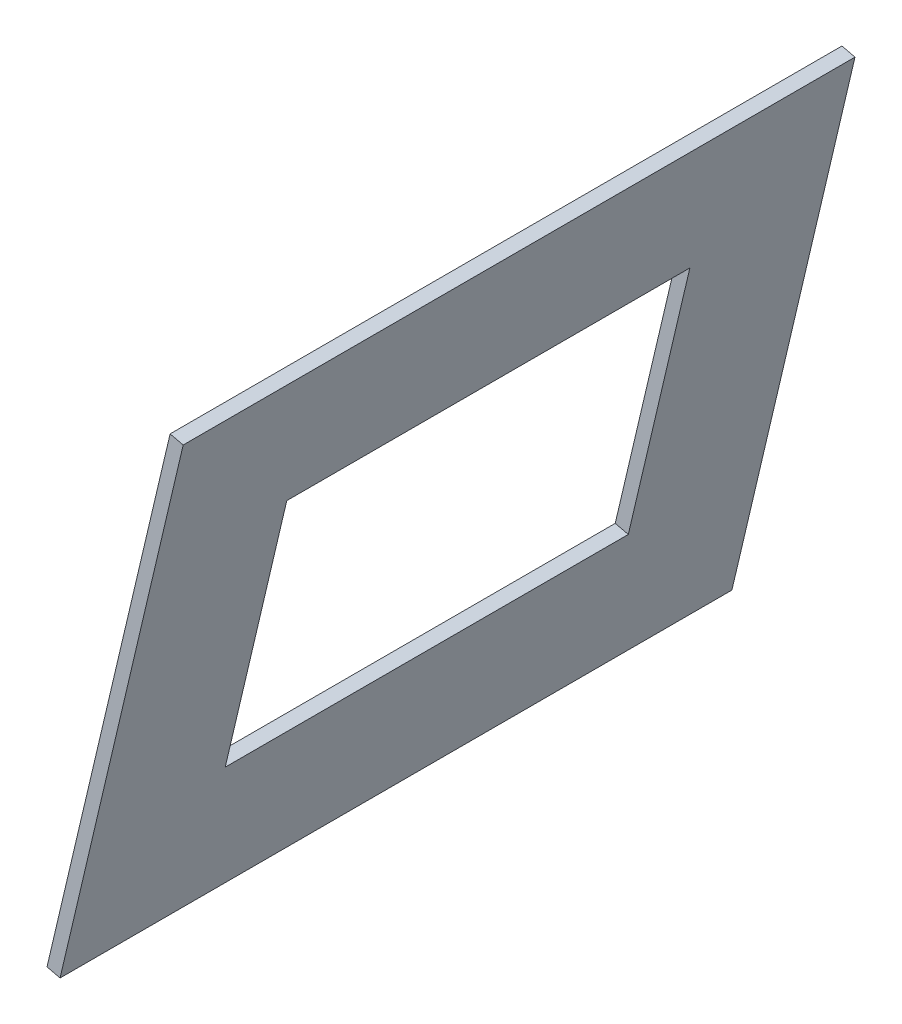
ISO-10303-21;
HEADER;
FILE_DESCRIPTION(('STEP AP214'),'2;1');
FILE_NAME('part.step','',(''),(''),'','','');
FILE_SCHEMA(('AUTOMOTIVE_DESIGN { 1 0 10303 214 1 1 1 1 }'));
ENDSEC;
DATA;
#1=APPLICATION_CONTEXT('core data for automotive mechanical design processes');
#2=APPLICATION_PROTOCOL_DEFINITION('international standard','automotive_design',2000,#1);
#3=PRODUCT_CONTEXT('',#1,'mechanical');
#4=PRODUCT('Part','Part','',(#3));
#5=PRODUCT_RELATED_PRODUCT_CATEGORY('part','',(#4));
#6=PRODUCT_DEFINITION_FORMATION('','',#4);
#7=PRODUCT_DEFINITION_CONTEXT('part definition',#1,'design');
#8=PRODUCT_DEFINITION('design','',#6,#7);
#9=PRODUCT_DEFINITION_SHAPE('','',#8);
#10=(LENGTH_UNIT() NAMED_UNIT(*) SI_UNIT(.MILLI.,.METRE.));
#11=(NAMED_UNIT(*) PLANE_ANGLE_UNIT() SI_UNIT($,.RADIAN.));
#12=(NAMED_UNIT(*) SI_UNIT($,.STERADIAN.) SOLID_ANGLE_UNIT());
#13=UNCERTAINTY_MEASURE_WITH_UNIT(LENGTH_MEASURE(1.E-05),#10,'distance_accuracy_value','');
#14=(GEOMETRIC_REPRESENTATION_CONTEXT(3) GLOBAL_UNCERTAINTY_ASSIGNED_CONTEXT((#13)) GLOBAL_UNIT_ASSIGNED_CONTEXT((#10,
#11,#12)) REPRESENTATION_CONTEXT('',''));
#15=CARTESIAN_POINT('',(0.,0.,0.));
#16=DIRECTION('',(0.,0.,1.));
#17=DIRECTION('',(1.,0.,0.));
#18=AXIS2_PLACEMENT_3D('',#15,#16,#17);
#19=CARTESIAN_POINT('',(-238.219832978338,152.785786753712,904.558696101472));
#20=DIRECTION('',(0.973408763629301,-0.2290750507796,0.));
#21=DIRECTION('',(0.2290750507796,0.973408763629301,0.));
#22=AXIS2_PLACEMENT_3D('',#19,#20,#21);
#23=PLANE('',#22);
#24=DIRECTION('',(0.,0.,-1.));
#25=VECTOR('',#24,1.);
#26=CARTESIAN_POINT('',(-215.312327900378,250.126663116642,904.558696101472));
#27=LINE('',#26,#25);
#28=CARTESIAN_POINT('',(-215.312327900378,250.126663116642,400.));
#29=VERTEX_POINT('',#28);
#30=CARTESIAN_POINT('',(-215.312327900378,250.126663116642,100.));
#31=VERTEX_POINT('',#30);
#32=EDGE_CURVE('E98',#29,#31,#27,.T.);
#33=ORIENTED_EDGE('',*,*,#32,.T.);
#34=DIRECTION('',(0.2290750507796,0.973408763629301,0.));
#35=VECTOR('',#34,1.);
#36=CARTESIAN_POINT('',(-238.219832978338,152.785786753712,100.));
#37=LINE('',#36,#35);
#38=CARTESIAN_POINT('',(-169.497317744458,444.808415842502,100.));
#39=VERTEX_POINT('',#38);
#40=EDGE_CURVE('E119',#31,#39,#37,.T.);
#41=ORIENTED_EDGE('',*,*,#40,.T.);
#42=DIRECTION('',(0.,0.,1.));
#43=VECTOR('',#42,1.);
#44=CARTESIAN_POINT('',(-169.497317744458,444.808415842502,904.558696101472));
#45=LINE('',#44,#43);
#46=CARTESIAN_POINT('',(-169.497317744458,444.808415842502,400.));
#47=VERTEX_POINT('',#46);
#48=EDGE_CURVE('E117',#39,#47,#45,.T.);
#49=ORIENTED_EDGE('',*,*,#48,.T.);
#50=DIRECTION('',(-0.2290750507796,-0.973408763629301,0.));
#51=VECTOR('',#50,1.);
#52=CARTESIAN_POINT('',(-238.219832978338,152.785786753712,400.));
#53=LINE('',#52,#51);
#54=EDGE_CURVE('E103',#47,#29,#53,.T.);
#55=ORIENTED_EDGE('',*,*,#54,.T.);
#56=EDGE_LOOP('',(#33,#41,#49,#55));
#57=FACE_BOUND('',#56,.T.);
#58=DIRECTION('',(-0.2290750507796,-0.973408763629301,0.));
#59=VECTOR('',#58,1.);
#60=CARTESIAN_POINT('',(-238.219832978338,152.785786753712,500.));
#61=LINE('',#60,#59);
#62=CARTESIAN_POINT('',(-146.589812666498,542.149292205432,500.));
#63=VERTEX_POINT('',#62);
#64=CARTESIAN_POINT('',(-238.219832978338,152.785786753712,500.));
#65=VERTEX_POINT('',#64);
#66=EDGE_CURVE('E130',#63,#65,#61,.T.);
#67=ORIENTED_EDGE('',*,*,#66,.F.);
#68=DIRECTION('',(0.,0.,-1.));
#69=VECTOR('',#68,1.);
#70=CARTESIAN_POINT('',(-146.589812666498,542.149292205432,904.558696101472));
#71=LINE('',#70,#69);
#72=CARTESIAN_POINT('',(-146.589812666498,542.149292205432,0.));
#73=VERTEX_POINT('',#72);
#74=EDGE_CURVE('E144',#63,#73,#71,.T.);
#75=ORIENTED_EDGE('',*,*,#74,.T.);
#76=DIRECTION('',(-0.2290750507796,-0.973408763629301,0.));
#77=VECTOR('',#76,1.);
#78=CARTESIAN_POINT('',(-238.219832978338,152.785786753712,0.));
#79=LINE('',#78,#77);
#80=CARTESIAN_POINT('',(-238.219832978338,152.785786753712,0.));
#81=VERTEX_POINT('',#80);
#82=EDGE_CURVE('E124',#73,#81,#79,.T.);
#83=ORIENTED_EDGE('',*,*,#82,.T.);
#84=DIRECTION('',(0.,0.,-1.));
#85=VECTOR('',#84,1.);
#86=CARTESIAN_POINT('',(-238.219832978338,152.785786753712,904.558696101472));
#87=LINE('',#86,#85);
#88=EDGE_CURVE('E128',#65,#81,#87,.T.);
#89=ORIENTED_EDGE('',*,*,#88,.F.);
#90=EDGE_LOOP('',(#67,#75,#83,#89));
#91=FACE_BOUND('',#90,.T.);
#92=ADVANCED_FACE('F37',(#57,#91),#23,.F.);
#93=CARTESIAN_POINT('',(-238.219832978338,152.785786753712,904.558696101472));
#94=DIRECTION('',(0.229075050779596,0.973408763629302,0.));
#95=DIRECTION('',(-0.973408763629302,0.229075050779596,0.));
#96=AXIS2_PLACEMENT_3D('',#93,#94,#95);
#97=PLANE('',#96);
#98=DIRECTION('',(0.973408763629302,-0.229075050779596,0.));
#99=VECTOR('',#98,1.);
#100=CARTESIAN_POINT('',(-238.219832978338,152.785786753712,500.));
#101=LINE('',#100,#99);
#102=CARTESIAN_POINT('',(-228.485745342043,150.495036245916,500.));
#103=VERTEX_POINT('',#102);
#104=EDGE_CURVE('E127',#65,#103,#101,.T.);
#105=ORIENTED_EDGE('',*,*,#104,.F.);
#106=ORIENTED_EDGE('',*,*,#88,.T.);
#107=DIRECTION('',(0.973408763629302,-0.229075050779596,0.));
#108=VECTOR('',#107,1.);
#109=CARTESIAN_POINT('',(-238.219832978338,152.785786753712,0.));
#110=LINE('',#109,#108);
#111=CARTESIAN_POINT('',(-228.485745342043,150.495036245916,0.));
#112=VERTEX_POINT('',#111);
#113=EDGE_CURVE('E135',#81,#112,#110,.T.);
#114=ORIENTED_EDGE('',*,*,#113,.T.);
#115=DIRECTION('',(0.,0.,-1.));
#116=VECTOR('',#115,1.);
#117=CARTESIAN_POINT('',(-228.485745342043,150.495036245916,904.558696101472));
#118=LINE('',#117,#116);
#119=EDGE_CURVE('E148',#103,#112,#118,.T.);
#120=ORIENTED_EDGE('',*,*,#119,.F.);
#121=EDGE_LOOP('',(#105,#106,#114,#120));
#122=FACE_BOUND('',#121,.T.);
#123=ADVANCED_FACE('F180',(#122),#97,.F.);
#124=CARTESIAN_POINT('',(-228.485745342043,150.495036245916,904.558696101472));
#125=DIRECTION('',(-0.973408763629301,0.229075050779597,0.));
#126=DIRECTION('',(-0.229075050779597,-0.973408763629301,0.));
#127=AXIS2_PLACEMENT_3D('',#124,#125,#126);
#128=PLANE('',#127);
#129=DIRECTION('',(0.,0.,-1.));
#130=VECTOR('',#129,1.);
#131=CARTESIAN_POINT('',(-159.763230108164,442.517665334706,904.558696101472));
#132=LINE('',#131,#130);
#133=CARTESIAN_POINT('',(-159.763230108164,442.517665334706,400.));
#134=VERTEX_POINT('',#133);
#135=CARTESIAN_POINT('',(-159.763230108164,442.517665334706,100.));
#136=VERTEX_POINT('',#135);
#137=EDGE_CURVE('E44',#134,#136,#132,.T.);
#138=ORIENTED_EDGE('',*,*,#137,.T.);
#139=DIRECTION('',(-0.229075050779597,-0.973408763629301,0.));
#140=VECTOR('',#139,1.);
#141=CARTESIAN_POINT('',(-228.485745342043,150.495036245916,100.));
#142=LINE('',#141,#140);
#143=CARTESIAN_POINT('',(-205.578240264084,247.835912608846,100.));
#144=VERTEX_POINT('',#143);
#145=EDGE_CURVE('E11',#136,#144,#142,.T.);
#146=ORIENTED_EDGE('',*,*,#145,.T.);
#147=DIRECTION('',(0.,0.,1.));
#148=VECTOR('',#147,1.);
#149=CARTESIAN_POINT('',(-205.578240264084,247.835912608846,904.558696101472));
#150=LINE('',#149,#148);
#151=CARTESIAN_POINT('',(-205.578240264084,247.835912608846,400.));
#152=VERTEX_POINT('',#151);
#153=EDGE_CURVE('E153',#144,#152,#150,.T.);
#154=ORIENTED_EDGE('',*,*,#153,.T.);
#155=DIRECTION('',(0.229075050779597,0.973408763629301,0.));
#156=VECTOR('',#155,1.);
#157=CARTESIAN_POINT('',(-228.485745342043,150.495036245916,400.));
#158=LINE('',#157,#156);
#159=EDGE_CURVE('E111',#152,#134,#158,.T.);
#160=ORIENTED_EDGE('',*,*,#159,.T.);
#161=EDGE_LOOP('',(#138,#146,#154,#160));
#162=FACE_BOUND('',#161,.T.);
#163=DIRECTION('',(0.229075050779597,0.973408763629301,0.));
#164=VECTOR('',#163,1.);
#165=CARTESIAN_POINT('',(-228.485745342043,150.495036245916,500.));
#166=LINE('',#165,#164);
#167=CARTESIAN_POINT('',(-136.855725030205,539.858541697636,500.));
#168=VERTEX_POINT('',#167);
#169=EDGE_CURVE('E125',#103,#168,#166,.T.);
#170=ORIENTED_EDGE('',*,*,#169,.F.);
#171=ORIENTED_EDGE('',*,*,#119,.T.);
#172=DIRECTION('',(0.229075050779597,0.973408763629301,0.));
#173=VECTOR('',#172,1.);
#174=CARTESIAN_POINT('',(-228.485745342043,150.495036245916,0.));
#175=LINE('',#174,#173);
#176=CARTESIAN_POINT('',(-136.855725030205,539.858541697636,0.));
#177=VERTEX_POINT('',#176);
#178=EDGE_CURVE('E138',#112,#177,#175,.T.);
#179=ORIENTED_EDGE('',*,*,#178,.T.);
#180=DIRECTION('',(0.,0.,-1.));
#181=VECTOR('',#180,1.);
#182=CARTESIAN_POINT('',(-136.855725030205,539.858541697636,904.558696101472));
#183=LINE('',#182,#181);
#184=EDGE_CURVE('E146',#168,#177,#183,.T.);
#185=ORIENTED_EDGE('',*,*,#184,.F.);
#186=EDGE_LOOP('',(#170,#171,#179,#185));
#187=FACE_BOUND('',#186,.T.);
#188=ADVANCED_FACE('F157',(#162,#187),#128,.F.);
#189=CARTESIAN_POINT('',(-146.589812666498,542.149292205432,904.558696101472));
#190=DIRECTION('',(-0.229075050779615,-0.973408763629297,0.));
#191=DIRECTION('',(0.973408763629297,-0.229075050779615,0.));
#192=AXIS2_PLACEMENT_3D('',#189,#190,#191);
#193=PLANE('',#192);
#194=DIRECTION('',(-0.973408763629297,0.229075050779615,0.));
#195=VECTOR('',#194,1.);
#196=CARTESIAN_POINT('',(-146.589812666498,542.149292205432,500.));
#197=LINE('',#196,#195);
#198=EDGE_CURVE('E132',#168,#63,#197,.T.);
#199=ORIENTED_EDGE('',*,*,#198,.F.);
#200=ORIENTED_EDGE('',*,*,#184,.T.);
#201=DIRECTION('',(-0.973408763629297,0.229075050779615,0.));
#202=VECTOR('',#201,1.);
#203=CARTESIAN_POINT('',(-146.589812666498,542.149292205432,0.));
#204=LINE('',#203,#202);
#205=EDGE_CURVE('E141',#177,#73,#204,.T.);
#206=ORIENTED_EDGE('',*,*,#205,.T.);
#207=ORIENTED_EDGE('',*,*,#74,.F.);
#208=EDGE_LOOP('',(#199,#200,#206,#207));
#209=FACE_BOUND('',#208,.T.);
#210=ADVANCED_FACE('F190',(#209),#193,.F.);
#211=CARTESIAN_POINT('',(0.,0.,0.));
#212=DIRECTION('',(0.,0.,-1.));
#213=DIRECTION('',(-1.,0.,0.));
#214=AXIS2_PLACEMENT_3D('',#211,#212,#213);
#215=PLANE('',#214);
#216=ORIENTED_EDGE('',*,*,#82,.F.);
#217=ORIENTED_EDGE('',*,*,#205,.F.);
#218=ORIENTED_EDGE('',*,*,#178,.F.);
#219=ORIENTED_EDGE('',*,*,#113,.F.);
#220=EDGE_LOOP('',(#216,#217,#218,#219));
#221=FACE_BOUND('',#220,.T.);
#222=ADVANCED_FACE('F175',(#221),#215,.T.);
#223=CARTESIAN_POINT('',(-164.822751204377,648.878970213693,500.));
#224=DIRECTION('',(0.,0.,1.));
#225=DIRECTION('',(1.,0.,0.));
#226=AXIS2_PLACEMENT_3D('',#223,#224,#225);
#227=PLANE('',#226);
#228=ORIENTED_EDGE('',*,*,#198,.T.);
#229=ORIENTED_EDGE('',*,*,#66,.T.);
#230=ORIENTED_EDGE('',*,*,#104,.T.);
#231=ORIENTED_EDGE('',*,*,#169,.T.);
#232=EDGE_LOOP('',(#228,#229,#230,#231));
#233=FACE_BOUND('',#232,.T.);
#234=ADVANCED_FACE('F168',(#233),#227,.T.);
#235=CARTESIAN_POINT('',(-118.756539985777,227.403915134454,100.));
#236=DIRECTION('',(0.,0.,-1.));
#237=DIRECTION('',(-1.,0.,0.));
#238=AXIS2_PLACEMENT_3D('',#235,#236,#237);
#239=PLANE('',#238);
#240=DIRECTION('',(-0.973408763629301,0.2290750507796,0.));
#241=VECTOR('',#240,1.);
#242=CARTESIAN_POINT('',(-118.756539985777,227.403915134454,100.));
#243=LINE('',#242,#241);
#244=EDGE_CURVE('E51',#144,#31,#243,.T.);
#245=ORIENTED_EDGE('',*,*,#244,.F.);
#246=ORIENTED_EDGE('',*,*,#145,.F.);
#247=DIRECTION('',(-0.973408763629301,0.2290750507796,0.));
#248=VECTOR('',#247,1.);
#249=CARTESIAN_POINT('',(-72.9415298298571,422.085667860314,100.));
#250=LINE('',#249,#248);
#251=EDGE_CURVE('E104',#136,#39,#250,.T.);
#252=ORIENTED_EDGE('',*,*,#251,.T.);
#253=ORIENTED_EDGE('',*,*,#40,.F.);
#254=EDGE_LOOP('',(#245,#246,#252,#253));
#255=FACE_BOUND('',#254,.T.);
#256=ADVANCED_FACE('F166',(#255),#239,.F.);
#257=CARTESIAN_POINT('',(-72.9415298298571,422.085667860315,400.));
#258=DIRECTION('',(0.2290750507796,0.973408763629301,0.));
#259=DIRECTION('',(-0.973408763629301,0.2290750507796,0.));
#260=AXIS2_PLACEMENT_3D('',#257,#258,#259);
#261=PLANE('',#260);
#262=ORIENTED_EDGE('',*,*,#251,.F.);
#263=ORIENTED_EDGE('',*,*,#137,.F.);
#264=DIRECTION('',(-0.973408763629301,0.2290750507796,0.));
#265=VECTOR('',#264,1.);
#266=CARTESIAN_POINT('',(-72.9415298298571,422.085667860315,400.));
#267=LINE('',#266,#265);
#268=EDGE_CURVE('E113',#134,#47,#267,.T.);
#269=ORIENTED_EDGE('',*,*,#268,.T.);
#270=ORIENTED_EDGE('',*,*,#48,.F.);
#271=EDGE_LOOP('',(#262,#263,#269,#270));
#272=FACE_BOUND('',#271,.T.);
#273=ADVANCED_FACE('F161',(#272),#261,.F.);
#274=CARTESIAN_POINT('',(-118.756539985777,227.403915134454,400.));
#275=DIRECTION('',(0.,0.,1.));
#276=DIRECTION('',(1.,0.,0.));
#277=AXIS2_PLACEMENT_3D('',#274,#275,#276);
#278=PLANE('',#277);
#279=ORIENTED_EDGE('',*,*,#268,.F.);
#280=ORIENTED_EDGE('',*,*,#159,.F.);
#281=DIRECTION('',(-0.973408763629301,0.2290750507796,0.));
#282=VECTOR('',#281,1.);
#283=CARTESIAN_POINT('',(-118.756539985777,227.403915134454,400.));
#284=LINE('',#283,#282);
#285=EDGE_CURVE('E56',#152,#29,#284,.T.);
#286=ORIENTED_EDGE('',*,*,#285,.T.);
#287=ORIENTED_EDGE('',*,*,#54,.F.);
#288=EDGE_LOOP('',(#279,#280,#286,#287));
#289=FACE_BOUND('',#288,.T.);
#290=ADVANCED_FACE('F108',(#289),#278,.F.);
#291=CARTESIAN_POINT('',(-118.756539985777,227.403915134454,400.));
#292=DIRECTION('',(-0.2290750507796,-0.973408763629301,0.));
#293=DIRECTION('',(0.973408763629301,-0.2290750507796,0.));
#294=AXIS2_PLACEMENT_3D('',#291,#292,#293);
#295=PLANE('',#294);
#296=ORIENTED_EDGE('',*,*,#285,.F.);
#297=ORIENTED_EDGE('',*,*,#153,.F.);
#298=ORIENTED_EDGE('',*,*,#244,.T.);
#299=ORIENTED_EDGE('',*,*,#32,.F.);
#300=EDGE_LOOP('',(#296,#297,#298,#299));
#301=FACE_BOUND('',#300,.T.);
#302=ADVANCED_FACE('F99',(#301),#295,.F.);
#303=CLOSED_SHELL('',(#92,#123,#188,#210,#222,#234,#256,#273,#290,#302));
#304=MANIFOLD_SOLID_BREP('B2',#303);
#305=ADVANCED_BREP_SHAPE_REPRESENTATION('',(#18,#304),#14);
#306=SHAPE_DEFINITION_REPRESENTATION(#9,#305);
ENDSEC;
END-ISO-10303-21;
